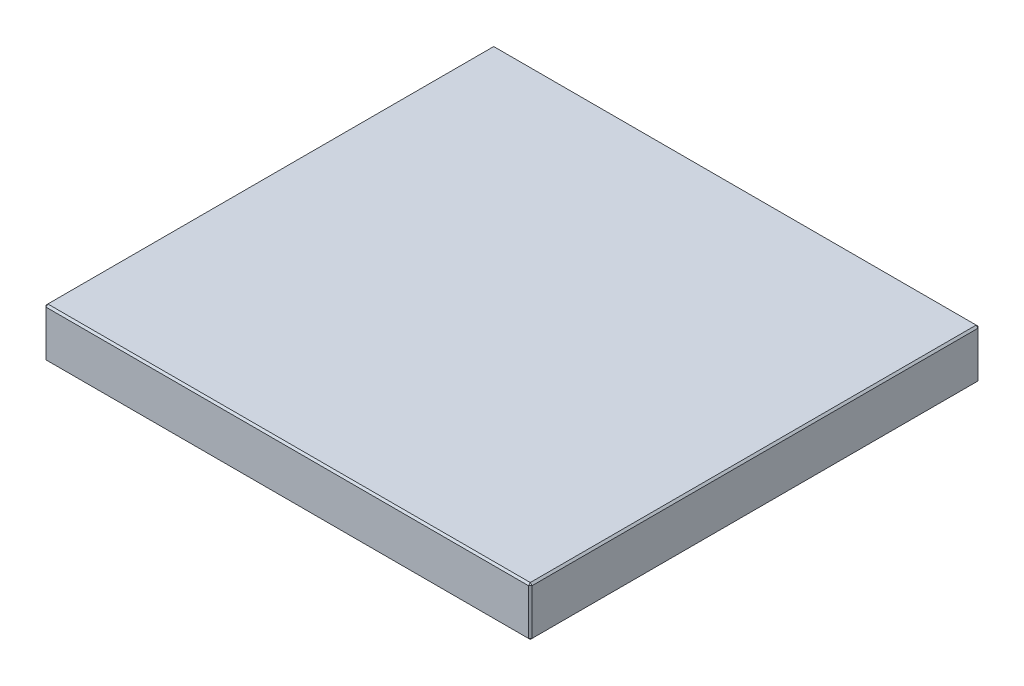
ISO-10303-21;
HEADER;
FILE_DESCRIPTION(('STEP AP214'),'2;1');
FILE_NAME('part.step','',(''),(''),'','','');
FILE_SCHEMA(('AUTOMOTIVE_DESIGN { 1 0 10303 214 1 1 1 1 }'));
ENDSEC;
DATA;
#1=APPLICATION_CONTEXT('core data for automotive mechanical design processes');
#2=APPLICATION_PROTOCOL_DEFINITION('international standard','automotive_design',2000,#1);
#3=PRODUCT_CONTEXT('',#1,'mechanical');
#4=PRODUCT('Part','Part','',(#3));
#5=PRODUCT_RELATED_PRODUCT_CATEGORY('part','',(#4));
#6=PRODUCT_DEFINITION_FORMATION('','',#4);
#7=PRODUCT_DEFINITION_CONTEXT('part definition',#1,'design');
#8=PRODUCT_DEFINITION('design','',#6,#7);
#9=PRODUCT_DEFINITION_SHAPE('','',#8);
#10=(LENGTH_UNIT() NAMED_UNIT(*) SI_UNIT(.MILLI.,.METRE.));
#11=(NAMED_UNIT(*) PLANE_ANGLE_UNIT() SI_UNIT($,.RADIAN.));
#12=(NAMED_UNIT(*) SI_UNIT($,.STERADIAN.) SOLID_ANGLE_UNIT());
#13=UNCERTAINTY_MEASURE_WITH_UNIT(LENGTH_MEASURE(1.E-05),#10,'distance_accuracy_value','');
#14=(GEOMETRIC_REPRESENTATION_CONTEXT(3) GLOBAL_UNCERTAINTY_ASSIGNED_CONTEXT((#13)) GLOBAL_UNIT_ASSIGNED_CONTEXT((#10,
#11,#12)) REPRESENTATION_CONTEXT('',''));
#15=CARTESIAN_POINT('',(0.,0.,0.));
#16=DIRECTION('',(0.,0.,1.));
#17=DIRECTION('',(1.,0.,0.));
#18=AXIS2_PLACEMENT_3D('',#15,#16,#17);
#19=CARTESIAN_POINT('',(-133.,27.,123.));
#20=DIRECTION('',(1.,0.,0.));
#21=DIRECTION('',(0.,0.,-1.));
#22=AXIS2_PLACEMENT_3D('',#19,#20,#21);
#23=PLANE('',#22);
#24=DIRECTION('',(0.,-1.,0.));
#25=VECTOR('',#24,1.);
#26=CARTESIAN_POINT('',(-133.,27.,-122.));
#27=LINE('',#26,#25);
#28=CARTESIAN_POINT('',(-133.,26.,-122.));
#29=VERTEX_POINT('',#28);
#30=CARTESIAN_POINT('',(-133.,1.,-122.));
#31=VERTEX_POINT('',#30);
#32=EDGE_CURVE('E115',#29,#31,#27,.T.);
#33=ORIENTED_EDGE('',*,*,#32,.T.);
#34=DIRECTION('',(0.,0.,1.));
#35=VECTOR('',#34,1.);
#36=CARTESIAN_POINT('',(-133.,1.,123.));
#37=LINE('',#36,#35);
#38=CARTESIAN_POINT('',(-133.,1.,122.));
#39=VERTEX_POINT('',#38);
#40=EDGE_CURVE('E111',#31,#39,#37,.T.);
#41=ORIENTED_EDGE('',*,*,#40,.T.);
#42=DIRECTION('',(0.,1.,0.));
#43=VECTOR('',#42,1.);
#44=CARTESIAN_POINT('',(-133.,27.,122.));
#45=LINE('',#44,#43);
#46=CARTESIAN_POINT('',(-133.,26.,122.));
#47=VERTEX_POINT('',#46);
#48=EDGE_CURVE('E104',#39,#47,#45,.T.);
#49=ORIENTED_EDGE('',*,*,#48,.T.);
#50=DIRECTION('',(0.,0.,-1.));
#51=VECTOR('',#50,1.);
#52=CARTESIAN_POINT('',(-133.,26.,-123.));
#53=LINE('',#52,#51);
#54=EDGE_CURVE('E108',#47,#29,#53,.T.);
#55=ORIENTED_EDGE('',*,*,#54,.T.);
#56=EDGE_LOOP('',(#33,#41,#49,#55));
#57=FACE_BOUND('',#56,.T.);
#58=ADVANCED_FACE('F16',(#57),#23,.F.);
#59=CARTESIAN_POINT('',(133.,27.,123.));
#60=DIRECTION('',(0.,0.,-1.));
#61=DIRECTION('',(-1.,0.,0.));
#62=AXIS2_PLACEMENT_3D('',#59,#60,#61);
#63=PLANE('',#62);
#64=DIRECTION('',(-1.,0.,0.));
#65=VECTOR('',#64,1.);
#66=CARTESIAN_POINT('',(-133.,26.,123.));
#67=LINE('',#66,#65);
#68=CARTESIAN_POINT('',(132.,26.,123.));
#69=VERTEX_POINT('',#68);
#70=CARTESIAN_POINT('',(-132.,26.,123.));
#71=VERTEX_POINT('',#70);
#72=EDGE_CURVE('E165',#69,#71,#67,.T.);
#73=ORIENTED_EDGE('',*,*,#72,.T.);
#74=DIRECTION('',(0.,-1.,0.));
#75=VECTOR('',#74,1.);
#76=CARTESIAN_POINT('',(-132.,27.,123.));
#77=LINE('',#76,#75);
#78=CARTESIAN_POINT('',(-132.,1.,123.));
#79=VERTEX_POINT('',#78);
#80=EDGE_CURVE('E123',#71,#79,#77,.T.);
#81=ORIENTED_EDGE('',*,*,#80,.T.);
#82=DIRECTION('',(1.,0.,0.));
#83=VECTOR('',#82,1.);
#84=CARTESIAN_POINT('',(133.,1.,123.));
#85=LINE('',#84,#83);
#86=CARTESIAN_POINT('',(132.,1.,123.));
#87=VERTEX_POINT('',#86);
#88=EDGE_CURVE('E169',#79,#87,#85,.T.);
#89=ORIENTED_EDGE('',*,*,#88,.T.);
#90=DIRECTION('',(0.,1.,0.));
#91=VECTOR('',#90,1.);
#92=CARTESIAN_POINT('',(132.,27.,123.));
#93=LINE('',#92,#91);
#94=EDGE_CURVE('E167',#87,#69,#93,.T.);
#95=ORIENTED_EDGE('',*,*,#94,.T.);
#96=EDGE_LOOP('',(#73,#81,#89,#95));
#97=FACE_BOUND('',#96,.T.);
#98=ADVANCED_FACE('F276',(#97),#63,.F.);
#99=CARTESIAN_POINT('',(133.,27.,123.));
#100=DIRECTION('',(-1.,0.,0.));
#101=DIRECTION('',(0.,0.,1.));
#102=AXIS2_PLACEMENT_3D('',#99,#100,#101);
#103=PLANE('',#102);
#104=DIRECTION('',(0.,0.,-1.));
#105=VECTOR('',#104,1.);
#106=CARTESIAN_POINT('',(133.,1.,123.));
#107=LINE('',#106,#105);
#108=CARTESIAN_POINT('',(133.,1.,122.));
#109=VERTEX_POINT('',#108);
#110=CARTESIAN_POINT('',(133.,1.,-122.));
#111=VERTEX_POINT('',#110);
#112=EDGE_CURVE('E160',#109,#111,#107,.T.);
#113=ORIENTED_EDGE('',*,*,#112,.T.);
#114=DIRECTION('',(0.,1.,0.));
#115=VECTOR('',#114,1.);
#116=CARTESIAN_POINT('',(133.,27.,-122.));
#117=LINE('',#116,#115);
#118=CARTESIAN_POINT('',(133.,26.,-122.));
#119=VERTEX_POINT('',#118);
#120=EDGE_CURVE('E162',#111,#119,#117,.T.);
#121=ORIENTED_EDGE('',*,*,#120,.T.);
#122=DIRECTION('',(0.,0.,1.));
#123=VECTOR('',#122,1.);
#124=CARTESIAN_POINT('',(133.,26.,123.));
#125=LINE('',#124,#123);
#126=CARTESIAN_POINT('',(133.,26.,122.));
#127=VERTEX_POINT('',#126);
#128=EDGE_CURVE('E156',#119,#127,#125,.T.);
#129=ORIENTED_EDGE('',*,*,#128,.T.);
#130=DIRECTION('',(0.,-1.,0.));
#131=VECTOR('',#130,1.);
#132=CARTESIAN_POINT('',(133.,27.,122.));
#133=LINE('',#132,#131);
#134=EDGE_CURVE('E158',#127,#109,#133,.T.);
#135=ORIENTED_EDGE('',*,*,#134,.T.);
#136=EDGE_LOOP('',(#113,#121,#129,#135));
#137=FACE_BOUND('',#136,.T.);
#138=ADVANCED_FACE('F255',(#137),#103,.F.);
#139=CARTESIAN_POINT('',(133.,27.,-123.));
#140=DIRECTION('',(0.,0.,1.));
#141=DIRECTION('',(1.,0.,0.));
#142=AXIS2_PLACEMENT_3D('',#139,#140,#141);
#143=PLANE('',#142);
#144=DIRECTION('',(0.,-1.,0.));
#145=VECTOR('',#144,1.);
#146=CARTESIAN_POINT('',(132.,27.,-123.));
#147=LINE('',#146,#145);
#148=CARTESIAN_POINT('',(132.,26.,-123.));
#149=VERTEX_POINT('',#148);
#150=CARTESIAN_POINT('',(132.,1.,-123.));
#151=VERTEX_POINT('',#150);
#152=EDGE_CURVE('E149',#149,#151,#147,.T.);
#153=ORIENTED_EDGE('',*,*,#152,.T.);
#154=DIRECTION('',(-1.,0.,0.));
#155=VECTOR('',#154,1.);
#156=CARTESIAN_POINT('',(133.,1.,-123.));
#157=LINE('',#156,#155);
#158=CARTESIAN_POINT('',(-132.,1.,-123.));
#159=VERTEX_POINT('',#158);
#160=EDGE_CURVE('E154',#151,#159,#157,.T.);
#161=ORIENTED_EDGE('',*,*,#160,.T.);
#162=DIRECTION('',(0.,1.,0.));
#163=VECTOR('',#162,1.);
#164=CARTESIAN_POINT('',(-132.,27.,-123.));
#165=LINE('',#164,#163);
#166=CARTESIAN_POINT('',(-132.,26.,-123.));
#167=VERTEX_POINT('',#166);
#168=EDGE_CURVE('E151',#159,#167,#165,.T.);
#169=ORIENTED_EDGE('',*,*,#168,.T.);
#170=DIRECTION('',(1.,0.,0.));
#171=VECTOR('',#170,1.);
#172=CARTESIAN_POINT('',(133.,26.,-123.));
#173=LINE('',#172,#171);
#174=EDGE_CURVE('E147',#167,#149,#173,.T.);
#175=ORIENTED_EDGE('',*,*,#174,.T.);
#176=EDGE_LOOP('',(#153,#161,#169,#175));
#177=FACE_BOUND('',#176,.T.);
#178=ADVANCED_FACE('F285',(#177),#143,.F.);
#179=CARTESIAN_POINT('',(0.,27.,0.));
#180=DIRECTION('',(0.,1.,0.));
#181=DIRECTION('',(0.,0.,1.));
#182=AXIS2_PLACEMENT_3D('',#179,#180,#181);
#183=PLANE('',#182);
#184=DIRECTION('',(0.,0.,-1.));
#185=VECTOR('',#184,1.);
#186=CARTESIAN_POINT('',(132.,27.,-123.));
#187=LINE('',#186,#185);
#188=CARTESIAN_POINT('',(132.,27.,122.));
#189=VERTEX_POINT('',#188);
#190=CARTESIAN_POINT('',(132.,27.,-122.));
#191=VERTEX_POINT('',#190);
#192=EDGE_CURVE('E25',#189,#191,#187,.T.);
#193=ORIENTED_EDGE('',*,*,#192,.T.);
#194=DIRECTION('',(-1.,0.,0.));
#195=VECTOR('',#194,1.);
#196=CARTESIAN_POINT('',(-133.,27.,-122.));
#197=LINE('',#196,#195);
#198=CARTESIAN_POINT('',(-132.,27.,-122.));
#199=VERTEX_POINT('',#198);
#200=EDGE_CURVE('E10',#191,#199,#197,.T.);
#201=ORIENTED_EDGE('',*,*,#200,.T.);
#202=DIRECTION('',(0.,0.,1.));
#203=VECTOR('',#202,1.);
#204=CARTESIAN_POINT('',(-132.,27.,123.));
#205=LINE('',#204,#203);
#206=CARTESIAN_POINT('',(-132.,27.,122.));
#207=VERTEX_POINT('',#206);
#208=EDGE_CURVE('E181',#199,#207,#205,.T.);
#209=ORIENTED_EDGE('',*,*,#208,.T.);
#210=DIRECTION('',(1.,0.,0.));
#211=VECTOR('',#210,1.);
#212=CARTESIAN_POINT('',(133.,27.,122.));
#213=LINE('',#212,#211);
#214=EDGE_CURVE('E36',#207,#189,#213,.T.);
#215=ORIENTED_EDGE('',*,*,#214,.T.);
#216=EDGE_LOOP('',(#193,#201,#209,#215));
#217=FACE_BOUND('',#216,.T.);
#218=ADVANCED_FACE('F351',(#217),#183,.T.);
#219=CARTESIAN_POINT('',(0.,0.,0.));
#220=DIRECTION('',(0.,1.,0.));
#221=DIRECTION('',(0.,0.,1.));
#222=AXIS2_PLACEMENT_3D('',#219,#220,#221);
#223=PLANE('',#222);
#224=DIRECTION('',(0.,0.,1.));
#225=VECTOR('',#224,1.);
#226=CARTESIAN_POINT('',(132.,0.,0.));
#227=LINE('',#226,#225);
#228=CARTESIAN_POINT('',(132.,0.,-122.));
#229=VERTEX_POINT('',#228);
#230=CARTESIAN_POINT('',(132.,0.,122.));
#231=VERTEX_POINT('',#230);
#232=EDGE_CURVE('E172',#229,#231,#227,.T.);
#233=ORIENTED_EDGE('',*,*,#232,.T.);
#234=DIRECTION('',(-1.,0.,0.));
#235=VECTOR('',#234,1.);
#236=CARTESIAN_POINT('',(0.,0.,122.));
#237=LINE('',#236,#235);
#238=CARTESIAN_POINT('',(-132.,0.,122.));
#239=VERTEX_POINT('',#238);
#240=EDGE_CURVE('E178',#231,#239,#237,.T.);
#241=ORIENTED_EDGE('',*,*,#240,.T.);
#242=DIRECTION('',(0.,0.,-1.));
#243=VECTOR('',#242,1.);
#244=CARTESIAN_POINT('',(-132.,0.,0.));
#245=LINE('',#244,#243);
#246=CARTESIAN_POINT('',(-132.,0.,-122.));
#247=VERTEX_POINT('',#246);
#248=EDGE_CURVE('E176',#239,#247,#245,.T.);
#249=ORIENTED_EDGE('',*,*,#248,.T.);
#250=DIRECTION('',(1.,0.,0.));
#251=VECTOR('',#250,1.);
#252=CARTESIAN_POINT('',(0.,0.,-122.));
#253=LINE('',#252,#251);
#254=EDGE_CURVE('E174',#247,#229,#253,.T.);
#255=ORIENTED_EDGE('',*,*,#254,.T.);
#256=EDGE_LOOP('',(#233,#241,#249,#255));
#257=FACE_BOUND('',#256,.T.);
#258=ADVANCED_FACE('F247',(#257),#223,.F.);
#259=CARTESIAN_POINT('',(133.,27.,122.));
#260=DIRECTION('',(-0.707106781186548,0.,-0.707106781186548));
#261=DIRECTION('',(0.,-1.,0.));
#262=AXIS2_PLACEMENT_3D('',#259,#260,#261);
#263=PLANE('',#262);
#264=DIRECTION('',(-0.707106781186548,0.,0.707106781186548));
#265=VECTOR('',#264,1.);
#266=CARTESIAN_POINT('',(132.,26.,123.));
#267=LINE('',#266,#265);
#268=EDGE_CURVE('E20',#69,#127,#267,.F.);
#269=ORIENTED_EDGE('',*,*,#268,.F.);
#270=ORIENTED_EDGE('',*,*,#94,.F.);
#271=DIRECTION('',(0.707106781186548,0.,-0.707106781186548));
#272=VECTOR('',#271,1.);
#273=CARTESIAN_POINT('',(132.,1.,123.));
#274=LINE('',#273,#272);
#275=EDGE_CURVE('E143',#109,#87,#274,.F.);
#276=ORIENTED_EDGE('',*,*,#275,.F.);
#277=ORIENTED_EDGE('',*,*,#134,.F.);
#278=EDGE_LOOP('',(#269,#270,#276,#277));
#279=FACE_BOUND('',#278,.T.);
#280=ADVANCED_FACE('F18',(#279),#263,.F.);
#281=CARTESIAN_POINT('',(132.,26.,123.));
#282=DIRECTION('',(0.577350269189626,0.577350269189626,0.577350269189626));
#283=DIRECTION('',(0.707106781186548,0.,-0.707106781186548));
#284=AXIS2_PLACEMENT_3D('',#281,#282,#283);
#285=PLANE('',#284);
#286=DIRECTION('',(0.,-0.707106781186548,0.707106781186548));
#287=VECTOR('',#286,1.);
#288=CARTESIAN_POINT('',(132.,26.,123.));
#289=LINE('',#288,#287);
#290=EDGE_CURVE('E227',#69,#189,#289,.F.);
#291=ORIENTED_EDGE('',*,*,#290,.F.);
#292=ORIENTED_EDGE('',*,*,#268,.T.);
#293=DIRECTION('',(-0.707106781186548,0.707106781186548,0.));
#294=VECTOR('',#293,1.);
#295=CARTESIAN_POINT('',(132.5,26.5,122.));
#296=LINE('',#295,#294);
#297=EDGE_CURVE('E229',#189,#127,#296,.F.);
#298=ORIENTED_EDGE('',*,*,#297,.F.);
#299=EDGE_LOOP('',(#291,#292,#298));
#300=FACE_BOUND('',#299,.T.);
#301=ADVANCED_FACE('F271',(#300),#285,.T.);
#302=CARTESIAN_POINT('',(132.,1.,123.));
#303=DIRECTION('',(0.577350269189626,-0.577350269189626,0.577350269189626));
#304=DIRECTION('',(0.707106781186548,0.,-0.707106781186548));
#305=AXIS2_PLACEMENT_3D('',#302,#303,#304);
#306=PLANE('',#305);
#307=DIRECTION('',(-0.707106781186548,-0.707106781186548,0.));
#308=VECTOR('',#307,1.);
#309=CARTESIAN_POINT('',(132.5,0.5,122.));
#310=LINE('',#309,#308);
#311=EDGE_CURVE('E221',#109,#231,#310,.T.);
#312=ORIENTED_EDGE('',*,*,#311,.F.);
#313=ORIENTED_EDGE('',*,*,#275,.T.);
#314=DIRECTION('',(0.,0.707106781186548,0.707106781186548));
#315=VECTOR('',#314,1.);
#316=CARTESIAN_POINT('',(132.,1.,123.));
#317=LINE('',#316,#315);
#318=EDGE_CURVE('E224',#231,#87,#317,.T.);
#319=ORIENTED_EDGE('',*,*,#318,.F.);
#320=EDGE_LOOP('',(#312,#313,#319));
#321=FACE_BOUND('',#320,.T.);
#322=ADVANCED_FACE('F236',(#321),#306,.T.);
#323=CARTESIAN_POINT('',(132.,27.,0.));
#324=DIRECTION('',(0.707106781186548,0.707106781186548,0.));
#325=DIRECTION('',(0.,0.,1.));
#326=AXIS2_PLACEMENT_3D('',#323,#324,#325);
#327=PLANE('',#326);
#328=ORIENTED_EDGE('',*,*,#297,.T.);
#329=ORIENTED_EDGE('',*,*,#128,.F.);
#330=DIRECTION('',(0.707106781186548,-0.707106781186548,0.));
#331=VECTOR('',#330,1.);
#332=CARTESIAN_POINT('',(133.,26.,-122.));
#333=LINE('',#332,#331);
#334=EDGE_CURVE('E216',#191,#119,#333,.T.);
#335=ORIENTED_EDGE('',*,*,#334,.F.);
#336=ORIENTED_EDGE('',*,*,#192,.F.);
#337=EDGE_LOOP('',(#328,#329,#335,#336));
#338=FACE_BOUND('',#337,.T.);
#339=ADVANCED_FACE('F266',(#338),#327,.T.);
#340=CARTESIAN_POINT('',(0.,27.,122.));
#341=DIRECTION('',(0.,0.707106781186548,0.707106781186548));
#342=DIRECTION('',(-1.,0.,0.));
#343=AXIS2_PLACEMENT_3D('',#340,#341,#342);
#344=PLANE('',#343);
#345=ORIENTED_EDGE('',*,*,#290,.T.);
#346=ORIENTED_EDGE('',*,*,#214,.F.);
#347=DIRECTION('',(0.,0.707106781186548,-0.707106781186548));
#348=VECTOR('',#347,1.);
#349=CARTESIAN_POINT('',(-132.,26.5,122.5));
#350=LINE('',#349,#348);
#351=EDGE_CURVE('E127',#71,#207,#350,.T.);
#352=ORIENTED_EDGE('',*,*,#351,.F.);
#353=ORIENTED_EDGE('',*,*,#72,.F.);
#354=EDGE_LOOP('',(#345,#346,#352,#353));
#355=FACE_BOUND('',#354,.T.);
#356=ADVANCED_FACE('F274',(#355),#344,.T.);
#357=CARTESIAN_POINT('',(-132.,27.,123.));
#358=DIRECTION('',(0.707106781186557,0.,-0.707106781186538));
#359=DIRECTION('',(0.,-1.,0.));
#360=AXIS2_PLACEMENT_3D('',#357,#358,#359);
#361=PLANE('',#360);
#362=DIRECTION('',(0.707106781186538,0.,0.707106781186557));
#363=VECTOR('',#362,1.);
#364=CARTESIAN_POINT('',(-132.,1.,123.));
#365=LINE('',#364,#363);
#366=EDGE_CURVE('E128',#79,#39,#365,.F.);
#367=ORIENTED_EDGE('',*,*,#366,.F.);
#368=ORIENTED_EDGE('',*,*,#80,.F.);
#369=DIRECTION('',(-0.707106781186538,0.,-0.707106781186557));
#370=VECTOR('',#369,1.);
#371=CARTESIAN_POINT('',(-133.,26.,122.));
#372=LINE('',#371,#370);
#373=EDGE_CURVE('E119',#47,#71,#372,.F.);
#374=ORIENTED_EDGE('',*,*,#373,.F.);
#375=ORIENTED_EDGE('',*,*,#48,.F.);
#376=EDGE_LOOP('',(#367,#368,#374,#375));
#377=FACE_BOUND('',#376,.T.);
#378=ADVANCED_FACE('F121',(#377),#361,.F.);
#379=CARTESIAN_POINT('',(133.,1.,123.));
#380=DIRECTION('',(0.,0.707106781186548,-0.707106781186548));
#381=DIRECTION('',(1.,0.,0.));
#382=AXIS2_PLACEMENT_3D('',#379,#380,#381);
#383=PLANE('',#382);
#384=ORIENTED_EDGE('',*,*,#318,.T.);
#385=ORIENTED_EDGE('',*,*,#88,.F.);
#386=DIRECTION('',(0.,-0.707106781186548,-0.707106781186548));
#387=VECTOR('',#386,1.);
#388=CARTESIAN_POINT('',(-132.,1.,123.));
#389=LINE('',#388,#387);
#390=EDGE_CURVE('E212',#239,#79,#389,.F.);
#391=ORIENTED_EDGE('',*,*,#390,.F.);
#392=ORIENTED_EDGE('',*,*,#240,.F.);
#393=EDGE_LOOP('',(#384,#385,#391,#392));
#394=FACE_BOUND('',#393,.T.);
#395=ADVANCED_FACE('F244',(#394),#383,.F.);
#396=CARTESIAN_POINT('',(133.,1.,123.));
#397=DIRECTION('',(-0.707106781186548,0.707106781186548,0.));
#398=DIRECTION('',(0.,0.,-1.));
#399=AXIS2_PLACEMENT_3D('',#396,#397,#398);
#400=PLANE('',#399);
#401=ORIENTED_EDGE('',*,*,#311,.T.);
#402=ORIENTED_EDGE('',*,*,#232,.F.);
#403=DIRECTION('',(0.707106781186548,0.707106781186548,0.));
#404=VECTOR('',#403,1.);
#405=CARTESIAN_POINT('',(132.5,0.5,-122.));
#406=LINE('',#405,#404);
#407=EDGE_CURVE('E209',#111,#229,#406,.F.);
#408=ORIENTED_EDGE('',*,*,#407,.F.);
#409=ORIENTED_EDGE('',*,*,#112,.F.);
#410=EDGE_LOOP('',(#401,#402,#408,#409));
#411=FACE_BOUND('',#410,.T.);
#412=ADVANCED_FACE('F252',(#411),#400,.F.);
#413=CARTESIAN_POINT('',(132.,27.,-123.));
#414=DIRECTION('',(-0.707106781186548,0.,0.707106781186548));
#415=DIRECTION('',(0.,-1.,0.));
#416=AXIS2_PLACEMENT_3D('',#413,#414,#415);
#417=PLANE('',#416);
#418=DIRECTION('',(0.707106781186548,0.,0.707106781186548));
#419=VECTOR('',#418,1.);
#420=CARTESIAN_POINT('',(133.,26.,-122.));
#421=LINE('',#420,#419);
#422=EDGE_CURVE('E218',#119,#149,#421,.F.);
#423=ORIENTED_EDGE('',*,*,#422,.F.);
#424=ORIENTED_EDGE('',*,*,#120,.F.);
#425=DIRECTION('',(-0.707106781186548,0.,-0.707106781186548));
#426=VECTOR('',#425,1.);
#427=CARTESIAN_POINT('',(132.,1.,-123.));
#428=LINE('',#427,#426);
#429=EDGE_CURVE('E206',#151,#111,#428,.F.);
#430=ORIENTED_EDGE('',*,*,#429,.F.);
#431=ORIENTED_EDGE('',*,*,#152,.F.);
#432=EDGE_LOOP('',(#423,#424,#430,#431));
#433=FACE_BOUND('',#432,.T.);
#434=ADVANCED_FACE('F259',(#433),#417,.F.);
#435=CARTESIAN_POINT('',(133.,26.,-122.));
#436=DIRECTION('',(0.577350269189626,0.577350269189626,-0.577350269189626));
#437=DIRECTION('',(-0.707106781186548,0.,-0.707106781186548));
#438=AXIS2_PLACEMENT_3D('',#435,#436,#437);
#439=PLANE('',#438);
#440=ORIENTED_EDGE('',*,*,#334,.T.);
#441=ORIENTED_EDGE('',*,*,#422,.T.);
#442=DIRECTION('',(0.,0.707106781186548,0.707106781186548));
#443=VECTOR('',#442,1.);
#444=CARTESIAN_POINT('',(132.,26.5,-122.5));
#445=LINE('',#444,#443);
#446=EDGE_CURVE('E135',#191,#149,#445,.F.);
#447=ORIENTED_EDGE('',*,*,#446,.F.);
#448=EDGE_LOOP('',(#440,#441,#447));
#449=FACE_BOUND('',#448,.T.);
#450=ADVANCED_FACE('F326',(#449),#439,.T.);
#451=CARTESIAN_POINT('',(-133.,26.,122.));
#452=DIRECTION('',(-0.577350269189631,0.577350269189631,0.577350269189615));
#453=DIRECTION('',(-0.707106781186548,-0.707106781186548,0.));
#454=AXIS2_PLACEMENT_3D('',#451,#452,#453);
#455=PLANE('',#454);
#456=ORIENTED_EDGE('',*,*,#373,.T.);
#457=ORIENTED_EDGE('',*,*,#351,.T.);
#458=DIRECTION('',(-0.707106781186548,-0.707106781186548,0.));
#459=VECTOR('',#458,1.);
#460=CARTESIAN_POINT('',(-133.,26.,122.));
#461=LINE('',#460,#459);
#462=EDGE_CURVE('E131',#47,#207,#461,.F.);
#463=ORIENTED_EDGE('',*,*,#462,.F.);
#464=EDGE_LOOP('',(#456,#457,#463));
#465=FACE_BOUND('',#464,.T.);
#466=ADVANCED_FACE('F132',(#465),#455,.T.);
#467=CARTESIAN_POINT('',(-132.,1.,123.));
#468=DIRECTION('',(-0.577350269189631,-0.577350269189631,0.577350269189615));
#469=DIRECTION('',(0.707106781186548,-0.707106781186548,0.));
#470=AXIS2_PLACEMENT_3D('',#467,#468,#469);
#471=PLANE('',#470);
#472=ORIENTED_EDGE('',*,*,#390,.T.);
#473=ORIENTED_EDGE('',*,*,#366,.T.);
#474=DIRECTION('',(-0.707106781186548,0.707106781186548,0.));
#475=VECTOR('',#474,1.);
#476=CARTESIAN_POINT('',(-132.5,0.500000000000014,122.));
#477=LINE('',#476,#475);
#478=EDGE_CURVE('E136',#239,#39,#477,.T.);
#479=ORIENTED_EDGE('',*,*,#478,.F.);
#480=EDGE_LOOP('',(#472,#473,#479));
#481=FACE_BOUND('',#480,.T.);
#482=ADVANCED_FACE('F319',(#481),#471,.T.);
#483=CARTESIAN_POINT('',(132.,1.,-123.));
#484=DIRECTION('',(0.577350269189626,-0.577350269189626,-0.577350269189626));
#485=DIRECTION('',(-0.707106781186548,0.,-0.707106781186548));
#486=AXIS2_PLACEMENT_3D('',#483,#484,#485);
#487=PLANE('',#486);
#488=ORIENTED_EDGE('',*,*,#429,.T.);
#489=ORIENTED_EDGE('',*,*,#407,.T.);
#490=DIRECTION('',(0.,-0.707106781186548,0.707106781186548));
#491=VECTOR('',#490,1.);
#492=CARTESIAN_POINT('',(132.,1.,-123.));
#493=LINE('',#492,#491);
#494=EDGE_CURVE('E199',#151,#229,#493,.T.);
#495=ORIENTED_EDGE('',*,*,#494,.F.);
#496=EDGE_LOOP('',(#488,#489,#495));
#497=FACE_BOUND('',#496,.T.);
#498=ADVANCED_FACE('F315',(#497),#487,.T.);
#499=CARTESIAN_POINT('',(0.,27.,-122.));
#500=DIRECTION('',(0.,0.707106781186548,-0.707106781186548));
#501=DIRECTION('',(1.,0.,0.));
#502=AXIS2_PLACEMENT_3D('',#499,#500,#501);
#503=PLANE('',#502);
#504=ORIENTED_EDGE('',*,*,#446,.T.);
#505=ORIENTED_EDGE('',*,*,#174,.F.);
#506=DIRECTION('',(0.,-0.707106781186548,-0.707106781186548));
#507=VECTOR('',#506,1.);
#508=CARTESIAN_POINT('',(-132.,26.,-123.));
#509=LINE('',#508,#507);
#510=EDGE_CURVE('E196',#199,#167,#509,.T.);
#511=ORIENTED_EDGE('',*,*,#510,.F.);
#512=ORIENTED_EDGE('',*,*,#200,.F.);
#513=EDGE_LOOP('',(#504,#505,#511,#512));
#514=FACE_BOUND('',#513,.T.);
#515=ADVANCED_FACE('F312',(#514),#503,.T.);
#516=CARTESIAN_POINT('',(-132.,27.,0.));
#517=DIRECTION('',(-0.707106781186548,0.707106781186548,0.));
#518=DIRECTION('',(0.,0.,-1.));
#519=AXIS2_PLACEMENT_3D('',#516,#517,#518);
#520=PLANE('',#519);
#521=ORIENTED_EDGE('',*,*,#462,.T.);
#522=ORIENTED_EDGE('',*,*,#208,.F.);
#523=DIRECTION('',(0.707106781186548,0.707106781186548,0.));
#524=VECTOR('',#523,1.);
#525=CARTESIAN_POINT('',(-132.5,26.5,-122.));
#526=LINE('',#525,#524);
#527=EDGE_CURVE('E139',#29,#199,#526,.T.);
#528=ORIENTED_EDGE('',*,*,#527,.F.);
#529=ORIENTED_EDGE('',*,*,#54,.F.);
#530=EDGE_LOOP('',(#521,#522,#528,#529));
#531=FACE_BOUND('',#530,.T.);
#532=ADVANCED_FACE('F138',(#531),#520,.T.);
#533=CARTESIAN_POINT('',(-133.,1.,123.));
#534=DIRECTION('',(0.707106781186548,0.707106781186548,0.));
#535=DIRECTION('',(0.,0.,1.));
#536=AXIS2_PLACEMENT_3D('',#533,#534,#535);
#537=PLANE('',#536);
#538=ORIENTED_EDGE('',*,*,#478,.T.);
#539=ORIENTED_EDGE('',*,*,#40,.F.);
#540=DIRECTION('',(0.707106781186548,-0.707106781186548,0.));
#541=VECTOR('',#540,1.);
#542=CARTESIAN_POINT('',(-133.,1.,-122.));
#543=LINE('',#542,#541);
#544=EDGE_CURVE('E192',#247,#31,#543,.F.);
#545=ORIENTED_EDGE('',*,*,#544,.F.);
#546=ORIENTED_EDGE('',*,*,#248,.F.);
#547=EDGE_LOOP('',(#538,#539,#545,#546));
#548=FACE_BOUND('',#547,.T.);
#549=ADVANCED_FACE('F305',(#548),#537,.F.);
#550=CARTESIAN_POINT('',(133.,1.,-123.));
#551=DIRECTION('',(0.,0.707106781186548,0.707106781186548));
#552=DIRECTION('',(-1.,0.,0.));
#553=AXIS2_PLACEMENT_3D('',#550,#551,#552);
#554=PLANE('',#553);
#555=ORIENTED_EDGE('',*,*,#494,.T.);
#556=ORIENTED_EDGE('',*,*,#254,.F.);
#557=DIRECTION('',(0.,0.707106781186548,-0.707106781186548));
#558=VECTOR('',#557,1.);
#559=CARTESIAN_POINT('',(-132.,0.500000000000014,-122.5));
#560=LINE('',#559,#558);
#561=EDGE_CURVE('E189',#159,#247,#560,.F.);
#562=ORIENTED_EDGE('',*,*,#561,.F.);
#563=ORIENTED_EDGE('',*,*,#160,.F.);
#564=EDGE_LOOP('',(#555,#556,#562,#563));
#565=FACE_BOUND('',#564,.T.);
#566=ADVANCED_FACE('F301',(#565),#554,.F.);
#567=CARTESIAN_POINT('',(-132.,26.,-123.));
#568=DIRECTION('',(-0.577350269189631,0.577350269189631,-0.577350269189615));
#569=DIRECTION('',(-0.707106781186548,-0.707106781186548,0.));
#570=AXIS2_PLACEMENT_3D('',#567,#568,#569);
#571=PLANE('',#570);
#572=ORIENTED_EDGE('',*,*,#527,.T.);
#573=ORIENTED_EDGE('',*,*,#510,.T.);
#574=DIRECTION('',(0.707106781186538,0.,-0.707106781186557));
#575=VECTOR('',#574,1.);
#576=CARTESIAN_POINT('',(-132.,26.,-123.));
#577=LINE('',#576,#575);
#578=EDGE_CURVE('E187',#29,#167,#577,.T.);
#579=ORIENTED_EDGE('',*,*,#578,.F.);
#580=EDGE_LOOP('',(#572,#573,#579));
#581=FACE_BOUND('',#580,.T.);
#582=ADVANCED_FACE('F297',(#581),#571,.T.);
#583=CARTESIAN_POINT('',(-133.,1.,-122.));
#584=DIRECTION('',(-0.577350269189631,-0.577350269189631,-0.577350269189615));
#585=DIRECTION('',(0.707106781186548,-0.707106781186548,0.));
#586=AXIS2_PLACEMENT_3D('',#583,#584,#585);
#587=PLANE('',#586);
#588=ORIENTED_EDGE('',*,*,#561,.T.);
#589=ORIENTED_EDGE('',*,*,#544,.T.);
#590=DIRECTION('',(-0.707106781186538,0.,0.707106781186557));
#591=VECTOR('',#590,1.);
#592=CARTESIAN_POINT('',(-133.,1.,-122.));
#593=LINE('',#592,#591);
#594=EDGE_CURVE('E185',#159,#31,#593,.T.);
#595=ORIENTED_EDGE('',*,*,#594,.F.);
#596=EDGE_LOOP('',(#588,#589,#595));
#597=FACE_BOUND('',#596,.T.);
#598=ADVANCED_FACE('F293',(#597),#587,.T.);
#599=CARTESIAN_POINT('',(-133.,27.,-122.));
#600=DIRECTION('',(0.707106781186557,0.,0.707106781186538));
#601=DIRECTION('',(0.,-1.,0.));
#602=AXIS2_PLACEMENT_3D('',#599,#600,#601);
#603=PLANE('',#602);
#604=ORIENTED_EDGE('',*,*,#578,.T.);
#605=ORIENTED_EDGE('',*,*,#168,.F.);
#606=ORIENTED_EDGE('',*,*,#594,.T.);
#607=ORIENTED_EDGE('',*,*,#32,.F.);
#608=EDGE_LOOP('',(#604,#605,#606,#607));
#609=FACE_BOUND('',#608,.T.);
#610=ADVANCED_FACE('F290',(#609),#603,.F.);
#611=CLOSED_SHELL('',(#58,#98,#138,#178,#218,#258,#280,#301,#322,#339,#356,#378,#395,#412,#434,
#450,#466,#482,#498,#515,#532,#549,#566,#582,#598,#610));
#612=MANIFOLD_SOLID_BREP('B1',#611);
#613=ADVANCED_BREP_SHAPE_REPRESENTATION('',(#18,#612),#14);
#614=SHAPE_DEFINITION_REPRESENTATION(#9,#613);
ENDSEC;
END-ISO-10303-21;
